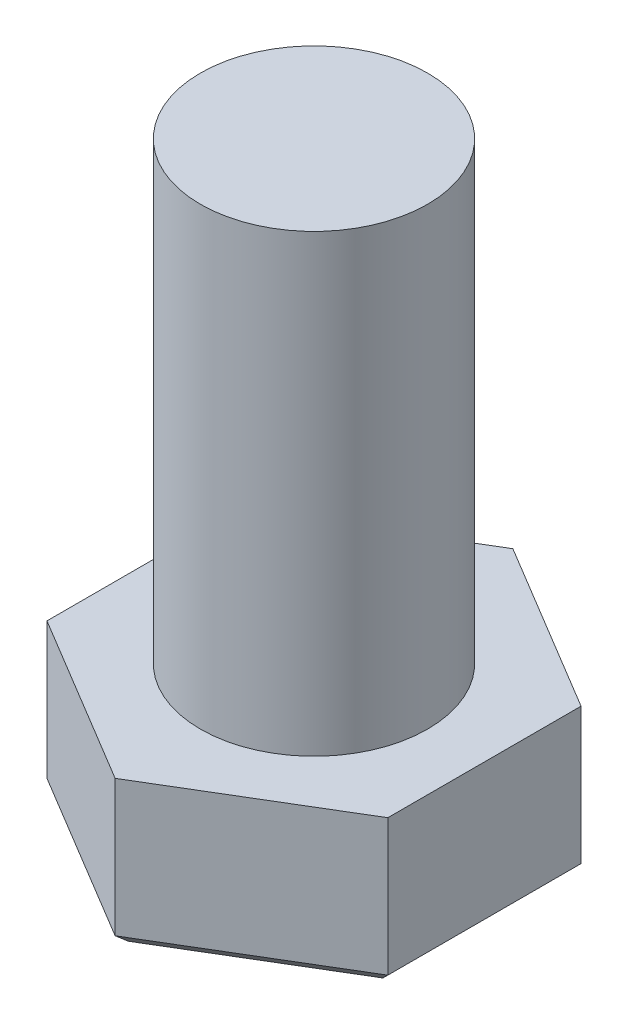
ISO-10303-21;
HEADER;
FILE_DESCRIPTION(('STEP AP214'),'2;1');
FILE_NAME('part.step','',(''),(''),'','','');
FILE_SCHEMA(('AUTOMOTIVE_DESIGN { 1 0 10303 214 1 1 1 1 }'));
ENDSEC;
DATA;
#1=APPLICATION_CONTEXT('core data for automotive mechanical design processes');
#2=APPLICATION_PROTOCOL_DEFINITION('international standard','automotive_design',2000,#1);
#3=PRODUCT_CONTEXT('',#1,'mechanical');
#4=PRODUCT('Part','Part','',(#3));
#5=PRODUCT_RELATED_PRODUCT_CATEGORY('part','',(#4));
#6=PRODUCT_DEFINITION_FORMATION('','',#4);
#7=PRODUCT_DEFINITION_CONTEXT('part definition',#1,'design');
#8=PRODUCT_DEFINITION('design','',#6,#7);
#9=PRODUCT_DEFINITION_SHAPE('','',#8);
#10=(LENGTH_UNIT() NAMED_UNIT(*) SI_UNIT(.MILLI.,.METRE.));
#11=(NAMED_UNIT(*) PLANE_ANGLE_UNIT() SI_UNIT($,.RADIAN.));
#12=(NAMED_UNIT(*) SI_UNIT($,.STERADIAN.) SOLID_ANGLE_UNIT());
#13=UNCERTAINTY_MEASURE_WITH_UNIT(LENGTH_MEASURE(1.E-05),#10,'distance_accuracy_value','');
#14=(GEOMETRIC_REPRESENTATION_CONTEXT(3) GLOBAL_UNCERTAINTY_ASSIGNED_CONTEXT((#13)) GLOBAL_UNIT_ASSIGNED_CONTEXT((#10,
#11,#12)) REPRESENTATION_CONTEXT('',''));
#15=CARTESIAN_POINT('',(0.,0.,0.));
#16=DIRECTION('',(0.,0.,1.));
#17=DIRECTION('',(1.,0.,0.));
#18=AXIS2_PLACEMENT_3D('',#15,#16,#17);
#19=CARTESIAN_POINT('',(0.,40.,0.));
#20=DIRECTION('',(0.,1.,0.));
#21=DIRECTION('',(-1.,0.,0.));
#22=AXIS2_PLACEMENT_3D('',#19,#20,#21);
#23=CYLINDRICAL_SURFACE('',#22,10.);
#24=CARTESIAN_POINT('',(0.,40.,0.));
#25=DIRECTION('',(0.,1.,0.));
#26=DIRECTION('',(-1.,0.,0.));
#27=AXIS2_PLACEMENT_3D('',#24,#25,#26);
#28=CIRCLE('',#27,10.);
#29=CARTESIAN_POINT('',(-10.,40.,0.));
#30=VERTEX_POINT('',#29);
#31=EDGE_CURVE('E154',#30,#30,#28,.T.);
#32=ORIENTED_EDGE('',*,*,#31,.F.);
#33=EDGE_LOOP('',(#32));
#34=FACE_BOUND('',#33,.T.);
#35=CARTESIAN_POINT('',(0.,0.,0.));
#36=DIRECTION('',(0.,-1.,0.));
#37=DIRECTION('',(1.,0.,0.));
#38=AXIS2_PLACEMENT_3D('',#35,#36,#37);
#39=CIRCLE('',#38,10.);
#40=CARTESIAN_POINT('',(10.,0.,0.));
#41=VERTEX_POINT('',#40);
#42=EDGE_CURVE('E114',#41,#41,#39,.T.);
#43=ORIENTED_EDGE('',*,*,#42,.F.);
#44=EDGE_LOOP('',(#43));
#45=FACE_BOUND('',#44,.T.);
#46=ADVANCED_FACE('F33',(#34,#45),#23,.T.);
#47=CARTESIAN_POINT('',(0.,40.,0.));
#48=DIRECTION('',(0.,-1.,0.));
#49=DIRECTION('',(1.,0.,0.));
#50=AXIS2_PLACEMENT_3D('',#47,#48,#49);
#51=PLANE('',#50);
#52=ORIENTED_EDGE('',*,*,#31,.T.);
#53=EDGE_LOOP('',(#52));
#54=FACE_BOUND('',#53,.T.);
#55=ADVANCED_FACE('F229',(#54),#51,.F.);
#56=CARTESIAN_POINT('',(29.1666666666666,0.,0.));
#57=DIRECTION('',(0.,-1.,0.));
#58=DIRECTION('',(1.,0.,0.));
#59=AXIS2_PLACEMENT_3D('',#56,#57,#58);
#60=PLANE('',#59);
#61=DIRECTION('',(-0.857492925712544,0.,0.514495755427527));
#62=VECTOR('',#61,1.);
#63=CARTESIAN_POINT('',(15.,0.,8.5));
#64=LINE('',#63,#62);
#65=CARTESIAN_POINT('',(15.,0.,8.5));
#66=VERTEX_POINT('',#65);
#67=CARTESIAN_POINT('',(0.,0.,17.5));
#68=VERTEX_POINT('',#67);
#69=EDGE_CURVE('E122',#66,#68,#64,.T.);
#70=ORIENTED_EDGE('',*,*,#69,.F.);
#71=DIRECTION('',(0.,0.,1.));
#72=VECTOR('',#71,1.);
#73=CARTESIAN_POINT('',(15.,0.,-8.49999999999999));
#74=LINE('',#73,#72);
#75=CARTESIAN_POINT('',(15.,0.,-8.49999999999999));
#76=VERTEX_POINT('',#75);
#77=EDGE_CURVE('E142',#76,#66,#74,.T.);
#78=ORIENTED_EDGE('',*,*,#77,.F.);
#79=DIRECTION('',(0.857492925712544,0.,0.514495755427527));
#80=VECTOR('',#79,1.);
#81=CARTESIAN_POINT('',(15.,0.,-8.49999999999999));
#82=LINE('',#81,#80);
#83=CARTESIAN_POINT('',(0.,0.,-17.5));
#84=VERTEX_POINT('',#83);
#85=EDGE_CURVE('E139',#84,#76,#82,.T.);
#86=ORIENTED_EDGE('',*,*,#85,.F.);
#87=DIRECTION('',(0.857492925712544,0.,-0.514495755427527));
#88=VECTOR('',#87,1.);
#89=CARTESIAN_POINT('',(-15.,0.,-8.5));
#90=LINE('',#89,#88);
#91=CARTESIAN_POINT('',(-15.,0.,-8.5));
#92=VERTEX_POINT('',#91);
#93=EDGE_CURVE('E136',#92,#84,#90,.T.);
#94=ORIENTED_EDGE('',*,*,#93,.F.);
#95=DIRECTION('',(0.,0.,-1.));
#96=VECTOR('',#95,1.);
#97=CARTESIAN_POINT('',(-15.,0.,-8.5));
#98=LINE('',#97,#96);
#99=CARTESIAN_POINT('',(-15.,0.,8.5));
#100=VERTEX_POINT('',#99);
#101=EDGE_CURVE('E125',#100,#92,#98,.T.);
#102=ORIENTED_EDGE('',*,*,#101,.F.);
#103=DIRECTION('',(-0.857492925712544,0.,-0.514495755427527));
#104=VECTOR('',#103,1.);
#105=CARTESIAN_POINT('',(-15.,0.,8.5));
#106=LINE('',#105,#104);
#107=EDGE_CURVE('E107',#68,#100,#106,.T.);
#108=ORIENTED_EDGE('',*,*,#107,.F.);
#109=EDGE_LOOP('',(#70,#78,#86,#94,#102,#108));
#110=FACE_BOUND('',#109,.T.);
#111=ORIENTED_EDGE('',*,*,#42,.T.);
#112=EDGE_LOOP('',(#111));
#113=FACE_BOUND('',#112,.T.);
#114=ADVANCED_FACE('F119',(#110,#113),#60,.F.);
#115=CARTESIAN_POINT('',(15.,-13.,8.5));
#116=DIRECTION('',(-0.514495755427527,0.,-0.857492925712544));
#117=DIRECTION('',(-0.857492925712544,0.,0.514495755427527));
#118=AXIS2_PLACEMENT_3D('',#115,#116,#117);
#119=PLANE('',#118);
#120=DIRECTION('',(0.,1.,0.));
#121=VECTOR('',#120,1.);
#122=CARTESIAN_POINT('',(0.,-13.,17.5));
#123=LINE('',#122,#121);
#124=CARTESIAN_POINT('',(0.,-12.,17.5));
#125=VERTEX_POINT('',#124);
#126=EDGE_CURVE('E104',#125,#68,#123,.T.);
#127=ORIENTED_EDGE('',*,*,#126,.F.);
#128=DIRECTION('',(0.857492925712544,0.,-0.514495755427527));
#129=VECTOR('',#128,1.);
#130=CARTESIAN_POINT('',(15.,-12.,8.5));
#131=LINE('',#130,#129);
#132=CARTESIAN_POINT('',(15.,-12.,8.5));
#133=VERTEX_POINT('',#132);
#134=EDGE_CURVE('E175',#125,#133,#131,.T.);
#135=ORIENTED_EDGE('',*,*,#134,.T.);
#136=DIRECTION('',(0.,1.,0.));
#137=VECTOR('',#136,1.);
#138=CARTESIAN_POINT('',(15.,-13.,8.5));
#139=LINE('',#138,#137);
#140=EDGE_CURVE('E129',#133,#66,#139,.T.);
#141=ORIENTED_EDGE('',*,*,#140,.T.);
#142=ORIENTED_EDGE('',*,*,#69,.T.);
#143=EDGE_LOOP('',(#127,#135,#141,#142));
#144=FACE_BOUND('',#143,.T.);
#145=ADVANCED_FACE('F127',(#144),#119,.F.);
#146=CARTESIAN_POINT('',(-15.,-13.,8.5));
#147=DIRECTION('',(0.514495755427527,0.,-0.857492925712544));
#148=DIRECTION('',(-0.857492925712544,0.,-0.514495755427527));
#149=AXIS2_PLACEMENT_3D('',#146,#147,#148);
#150=PLANE('',#149);
#151=DIRECTION('',(0.,1.,0.));
#152=VECTOR('',#151,1.);
#153=CARTESIAN_POINT('',(-15.,-13.,8.5));
#154=LINE('',#153,#152);
#155=CARTESIAN_POINT('',(-15.,-12.,8.5));
#156=VERTEX_POINT('',#155);
#157=EDGE_CURVE('E115',#156,#100,#154,.T.);
#158=ORIENTED_EDGE('',*,*,#157,.F.);
#159=DIRECTION('',(0.857492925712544,0.,0.514495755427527));
#160=VECTOR('',#159,1.);
#161=CARTESIAN_POINT('',(0.,-12.,17.5));
#162=LINE('',#161,#160);
#163=EDGE_CURVE('E110',#156,#125,#162,.T.);
#164=ORIENTED_EDGE('',*,*,#163,.T.);
#165=ORIENTED_EDGE('',*,*,#126,.T.);
#166=ORIENTED_EDGE('',*,*,#107,.T.);
#167=EDGE_LOOP('',(#158,#164,#165,#166));
#168=FACE_BOUND('',#167,.T.);
#169=ADVANCED_FACE('F106',(#168),#150,.F.);
#170=CARTESIAN_POINT('',(-15.,-13.,-8.5));
#171=DIRECTION('',(1.,0.,0.));
#172=DIRECTION('',(0.,0.,-1.));
#173=AXIS2_PLACEMENT_3D('',#170,#171,#172);
#174=PLANE('',#173);
#175=DIRECTION('',(0.,1.,0.));
#176=VECTOR('',#175,1.);
#177=CARTESIAN_POINT('',(-15.,-13.,-8.5));
#178=LINE('',#177,#176);
#179=CARTESIAN_POINT('',(-15.,-12.,-8.5));
#180=VERTEX_POINT('',#179);
#181=EDGE_CURVE('E149',#180,#92,#178,.T.);
#182=ORIENTED_EDGE('',*,*,#181,.F.);
#183=DIRECTION('',(0.,0.,1.));
#184=VECTOR('',#183,1.);
#185=CARTESIAN_POINT('',(-15.,-12.,8.5));
#186=LINE('',#185,#184);
#187=EDGE_CURVE('E42',#180,#156,#186,.T.);
#188=ORIENTED_EDGE('',*,*,#187,.T.);
#189=ORIENTED_EDGE('',*,*,#157,.T.);
#190=ORIENTED_EDGE('',*,*,#101,.T.);
#191=EDGE_LOOP('',(#182,#188,#189,#190));
#192=FACE_BOUND('',#191,.T.);
#193=ADVANCED_FACE('F307',(#192),#174,.F.);
#194=CARTESIAN_POINT('',(-15.,-13.,-8.5));
#195=DIRECTION('',(0.514495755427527,0.,0.857492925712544));
#196=DIRECTION('',(0.857492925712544,0.,-0.514495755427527));
#197=AXIS2_PLACEMENT_3D('',#194,#195,#196);
#198=PLANE('',#197);
#199=DIRECTION('',(0.,1.,0.));
#200=VECTOR('',#199,1.);
#201=CARTESIAN_POINT('',(0.,-13.,-17.5));
#202=LINE('',#201,#200);
#203=CARTESIAN_POINT('',(0.,-12.,-17.5));
#204=VERTEX_POINT('',#203);
#205=EDGE_CURVE('E147',#204,#84,#202,.T.);
#206=ORIENTED_EDGE('',*,*,#205,.F.);
#207=DIRECTION('',(-0.857492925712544,0.,0.514495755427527));
#208=VECTOR('',#207,1.);
#209=CARTESIAN_POINT('',(-15.,-12.,-8.5));
#210=LINE('',#209,#208);
#211=EDGE_CURVE('E11',#204,#180,#210,.T.);
#212=ORIENTED_EDGE('',*,*,#211,.T.);
#213=ORIENTED_EDGE('',*,*,#181,.T.);
#214=ORIENTED_EDGE('',*,*,#93,.T.);
#215=EDGE_LOOP('',(#206,#212,#213,#214));
#216=FACE_BOUND('',#215,.T.);
#217=ADVANCED_FACE('F299',(#216),#198,.F.);
#218=CARTESIAN_POINT('',(15.,-13.,-8.49999999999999));
#219=DIRECTION('',(-0.514495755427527,0.,0.857492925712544));
#220=DIRECTION('',(0.857492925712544,0.,0.514495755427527));
#221=AXIS2_PLACEMENT_3D('',#218,#219,#220);
#222=PLANE('',#221);
#223=DIRECTION('',(0.,1.,0.));
#224=VECTOR('',#223,1.);
#225=CARTESIAN_POINT('',(15.,-13.,-8.49999999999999));
#226=LINE('',#225,#224);
#227=CARTESIAN_POINT('',(15.,-12.,-8.49999999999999));
#228=VERTEX_POINT('',#227);
#229=EDGE_CURVE('E145',#228,#76,#226,.T.);
#230=ORIENTED_EDGE('',*,*,#229,.F.);
#231=DIRECTION('',(-0.857492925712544,0.,-0.514495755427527));
#232=VECTOR('',#231,1.);
#233=CARTESIAN_POINT('',(0.,-12.,-17.5));
#234=LINE('',#233,#232);
#235=EDGE_CURVE('E170',#228,#204,#234,.T.);
#236=ORIENTED_EDGE('',*,*,#235,.T.);
#237=ORIENTED_EDGE('',*,*,#205,.T.);
#238=ORIENTED_EDGE('',*,*,#85,.T.);
#239=EDGE_LOOP('',(#230,#236,#237,#238));
#240=FACE_BOUND('',#239,.T.);
#241=ADVANCED_FACE('F212',(#240),#222,.F.);
#242=CARTESIAN_POINT('',(15.,-13.,-8.49999999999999));
#243=DIRECTION('',(-1.,0.,0.));
#244=DIRECTION('',(0.,0.,1.));
#245=AXIS2_PLACEMENT_3D('',#242,#243,#244);
#246=PLANE('',#245);
#247=ORIENTED_EDGE('',*,*,#140,.F.);
#248=DIRECTION('',(0.,0.,-1.));
#249=VECTOR('',#248,1.);
#250=CARTESIAN_POINT('',(15.,-12.,-8.49999999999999));
#251=LINE('',#250,#249);
#252=EDGE_CURVE('E173',#133,#228,#251,.T.);
#253=ORIENTED_EDGE('',*,*,#252,.T.);
#254=ORIENTED_EDGE('',*,*,#229,.T.);
#255=ORIENTED_EDGE('',*,*,#77,.T.);
#256=EDGE_LOOP('',(#247,#253,#254,#255));
#257=FACE_BOUND('',#256,.T.);
#258=ADVANCED_FACE('F209',(#257),#246,.F.);
#259=CARTESIAN_POINT('',(29.1666666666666,-13.,0.));
#260=DIRECTION('',(0.,-1.,0.));
#261=DIRECTION('',(1.,0.,0.));
#262=AXIS2_PLACEMENT_3D('',#259,#260,#261);
#263=PLANE('',#262);
#264=DIRECTION('',(0.857492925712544,0.,-0.514495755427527));
#265=VECTOR('',#264,1.);
#266=CARTESIAN_POINT('',(0.514495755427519,-13.,-16.6425070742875));
#267=LINE('',#266,#265);
#268=CARTESIAN_POINT('',(-14.,-13.,-7.93380962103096));
#269=VERTEX_POINT('',#268);
#270=CARTESIAN_POINT('',(0.,-13.,-16.333809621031));
#271=VERTEX_POINT('',#270);
#272=EDGE_CURVE('E157',#269,#271,#267,.T.);
#273=ORIENTED_EDGE('',*,*,#272,.T.);
#274=DIRECTION('',(0.857492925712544,0.,0.514495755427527));
#275=VECTOR('',#274,1.);
#276=CARTESIAN_POINT('',(14.4855042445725,-13.,-7.64250707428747));
#277=LINE('',#276,#275);
#278=CARTESIAN_POINT('',(14.,-13.,-7.93380962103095));
#279=VERTEX_POINT('',#278);
#280=EDGE_CURVE('E167',#271,#279,#277,.T.);
#281=ORIENTED_EDGE('',*,*,#280,.T.);
#282=DIRECTION('',(0.,0.,1.));
#283=VECTOR('',#282,1.);
#284=CARTESIAN_POINT('',(14.,-13.,8.5));
#285=LINE('',#284,#283);
#286=CARTESIAN_POINT('',(14.,-13.,7.93380962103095));
#287=VERTEX_POINT('',#286);
#288=EDGE_CURVE('E165',#279,#287,#285,.T.);
#289=ORIENTED_EDGE('',*,*,#288,.T.);
#290=DIRECTION('',(-0.857492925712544,0.,0.514495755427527));
#291=VECTOR('',#290,1.);
#292=CARTESIAN_POINT('',(-0.514495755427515,-13.,16.6425070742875));
#293=LINE('',#292,#291);
#294=CARTESIAN_POINT('',(0.,-13.,16.333809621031));
#295=VERTEX_POINT('',#294);
#296=EDGE_CURVE('E163',#287,#295,#293,.T.);
#297=ORIENTED_EDGE('',*,*,#296,.T.);
#298=DIRECTION('',(-0.857492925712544,0.,-0.514495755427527));
#299=VECTOR('',#298,1.);
#300=CARTESIAN_POINT('',(-14.4855042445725,-13.,7.64250707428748));
#301=LINE('',#300,#299);
#302=CARTESIAN_POINT('',(-14.,-13.,7.93380962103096));
#303=VERTEX_POINT('',#302);
#304=EDGE_CURVE('E161',#295,#303,#301,.T.);
#305=ORIENTED_EDGE('',*,*,#304,.T.);
#306=DIRECTION('',(0.,0.,-1.));
#307=VECTOR('',#306,1.);
#308=CARTESIAN_POINT('',(-14.,-13.,-8.5));
#309=LINE('',#308,#307);
#310=EDGE_CURVE('E159',#303,#269,#309,.T.);
#311=ORIENTED_EDGE('',*,*,#310,.T.);
#312=EDGE_LOOP('',(#273,#281,#289,#297,#305,#311));
#313=FACE_BOUND('',#312,.T.);
#314=ADVANCED_FACE('F199',(#313),#263,.T.);
#315=CARTESIAN_POINT('',(14.2399859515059,-13.,24.8778011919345));
#316=DIRECTION('',(-0.363803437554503,-0.707106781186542,0.606339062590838));
#317=DIRECTION('',(0.,-0.650944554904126,-0.759125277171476));
#318=AXIS2_PLACEMENT_3D('',#315,#316,#317);
#319=PLANE('',#318);
#320=DIRECTION('',(0.,0.650944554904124,0.759125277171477));
#321=VECTOR('',#320,1.);
#322=CARTESIAN_POINT('',(0.,-8.77799967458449,21.2574657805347));
#323=LINE('',#322,#321);
#324=EDGE_CURVE('E133',#125,#295,#323,.F.);
#325=ORIENTED_EDGE('',*,*,#324,.F.);
#326=ORIENTED_EDGE('',*,*,#163,.F.);
#327=DIRECTION('',(-0.656451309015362,0.65645130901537,0.371676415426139));
#328=VECTOR('',#327,1.);
#329=CARTESIAN_POINT('',(-12.0642498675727,-14.9357501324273,6.83780651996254));
#330=LINE('',#329,#328);
#331=EDGE_CURVE('E37',#303,#156,#330,.T.);
#332=ORIENTED_EDGE('',*,*,#331,.F.);
#333=ORIENTED_EDGE('',*,*,#304,.F.);
#334=EDGE_LOOP('',(#325,#326,#332,#333));
#335=FACE_BOUND('',#334,.T.);
#336=ADVANCED_FACE('F35',(#335),#319,.T.);
#337=CARTESIAN_POINT('',(-14.,-13.,0.));
#338=DIRECTION('',(-0.707106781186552,-0.707106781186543,0.));
#339=DIRECTION('',(0.707106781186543,-0.707106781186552,0.));
#340=AXIS2_PLACEMENT_3D('',#337,#338,#339);
#341=PLANE('',#340);
#342=ORIENTED_EDGE('',*,*,#331,.T.);
#343=ORIENTED_EDGE('',*,*,#187,.F.);
#344=DIRECTION('',(-0.656451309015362,0.656451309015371,-0.371676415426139));
#345=VECTOR('',#344,1.);
#346=CARTESIAN_POINT('',(-5.96471189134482,-21.0352881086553,-3.38430680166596));
#347=LINE('',#346,#345);
#348=EDGE_CURVE('E186',#269,#180,#347,.T.);
#349=ORIENTED_EDGE('',*,*,#348,.F.);
#350=ORIENTED_EDGE('',*,*,#310,.F.);
#351=EDGE_LOOP('',(#342,#343,#349,#350));
#352=FACE_BOUND('',#351,.T.);
#353=ADVANCED_FACE('F221',(#352),#341,.T.);
#354=CARTESIAN_POINT('',(28.6521709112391,-13.,-0.857492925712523));
#355=DIRECTION('',(0.363803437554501,-0.707106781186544,0.606339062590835));
#356=DIRECTION('',(0.,-0.650944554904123,-0.759125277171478));
#357=AXIS2_PLACEMENT_3D('',#354,#355,#356);
#358=PLANE('',#357);
#359=ORIENTED_EDGE('',*,*,#324,.T.);
#360=ORIENTED_EDGE('',*,*,#296,.F.);
#361=DIRECTION('',(0.656451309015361,0.656451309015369,0.371676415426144));
#362=VECTOR('',#361,1.);
#363=CARTESIAN_POINT('',(18.1690677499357,-8.83093225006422,10.2942956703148));
#364=LINE('',#363,#362);
#365=EDGE_CURVE('E183',#133,#287,#364,.F.);
#366=ORIENTED_EDGE('',*,*,#365,.F.);
#367=ORIENTED_EDGE('',*,*,#134,.F.);
#368=EDGE_LOOP('',(#359,#360,#366,#367));
#369=FACE_BOUND('',#368,.T.);
#370=ADVANCED_FACE('F192',(#369),#358,.T.);
#371=CARTESIAN_POINT('',(14.2399859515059,-13.,-24.8778011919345));
#372=DIRECTION('',(-0.363803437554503,-0.707106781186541,-0.606339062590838));
#373=DIRECTION('',(0.,0.650944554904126,-0.759125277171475));
#374=AXIS2_PLACEMENT_3D('',#371,#372,#373);
#375=PLANE('',#374);
#376=ORIENTED_EDGE('',*,*,#348,.T.);
#377=ORIENTED_EDGE('',*,*,#211,.F.);
#378=DIRECTION('',(0.,-0.650944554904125,0.759125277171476));
#379=VECTOR('',#378,1.);
#380=CARTESIAN_POINT('',(0.,-8.77799967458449,-21.2574657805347));
#381=LINE('',#380,#379);
#382=EDGE_CURVE('E181',#271,#204,#381,.F.);
#383=ORIENTED_EDGE('',*,*,#382,.F.);
#384=ORIENTED_EDGE('',*,*,#272,.F.);
#385=EDGE_LOOP('',(#376,#377,#383,#384));
#386=FACE_BOUND('',#385,.T.);
#387=ADVANCED_FACE('F219',(#386),#375,.T.);
#388=CARTESIAN_POINT('',(14.,-13.,0.));
#389=DIRECTION('',(0.707106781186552,-0.707106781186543,0.));
#390=DIRECTION('',(0.707106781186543,0.707106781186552,0.));
#391=AXIS2_PLACEMENT_3D('',#388,#389,#390);
#392=PLANE('',#391);
#393=ORIENTED_EDGE('',*,*,#365,.T.);
#394=ORIENTED_EDGE('',*,*,#288,.F.);
#395=DIRECTION('',(0.656451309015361,0.656451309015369,-0.371676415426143));
#396=VECTOR('',#395,1.);
#397=CARTESIAN_POINT('',(12.0642498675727,-14.9357501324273,-6.83780651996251));
#398=LINE('',#397,#396);
#399=EDGE_CURVE('E179',#228,#279,#398,.F.);
#400=ORIENTED_EDGE('',*,*,#399,.F.);
#401=ORIENTED_EDGE('',*,*,#252,.F.);
#402=EDGE_LOOP('',(#393,#394,#400,#401));
#403=FACE_BOUND('',#402,.T.);
#404=ADVANCED_FACE('F205',(#403),#392,.T.);
#405=CARTESIAN_POINT('',(28.6521709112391,-13.,0.857492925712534));
#406=DIRECTION('',(0.363803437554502,-0.707106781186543,-0.606339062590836));
#407=DIRECTION('',(0.,0.650944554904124,-0.759125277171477));
#408=AXIS2_PLACEMENT_3D('',#405,#406,#407);
#409=PLANE('',#408);
#410=ORIENTED_EDGE('',*,*,#382,.T.);
#411=ORIENTED_EDGE('',*,*,#235,.F.);
#412=ORIENTED_EDGE('',*,*,#399,.T.);
#413=ORIENTED_EDGE('',*,*,#280,.F.);
#414=EDGE_LOOP('',(#410,#411,#412,#413));
#415=FACE_BOUND('',#414,.T.);
#416=ADVANCED_FACE('F215',(#415),#409,.T.);
#417=CLOSED_SHELL('',(#46,#55,#114,#145,#169,#193,#217,#241,#258,#314,#336,#353,#370,#387,#404,#416));
#418=MANIFOLD_SOLID_BREP('B2',#417);
#419=ADVANCED_BREP_SHAPE_REPRESENTATION('',(#18,#418),#14);
#420=SHAPE_DEFINITION_REPRESENTATION(#9,#419);
ENDSEC;
END-ISO-10303-21;
